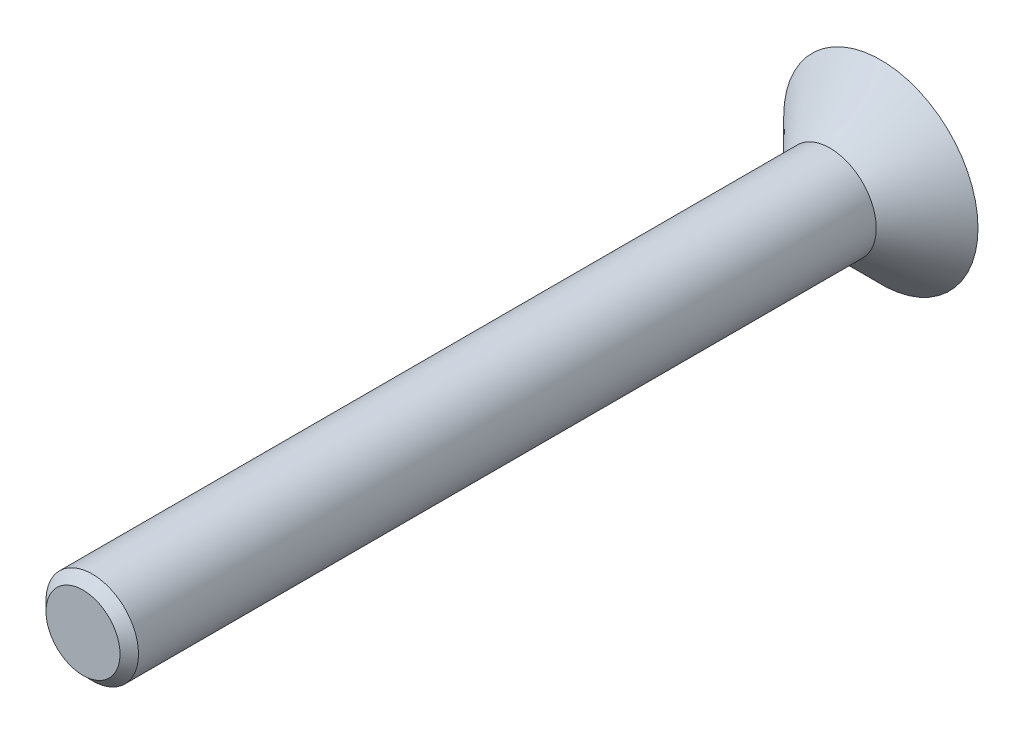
ISO-10303-21;
HEADER;
FILE_DESCRIPTION(('STEP AP214'),'2;1');
FILE_NAME('part.step','',(''),(''),'','','');
FILE_SCHEMA(('AUTOMOTIVE_DESIGN { 1 0 10303 214 1 1 1 1 }'));
ENDSEC;
DATA;
#1=APPLICATION_CONTEXT('core data for automotive mechanical design processes');
#2=APPLICATION_PROTOCOL_DEFINITION('international standard','automotive_design',2000,#1);
#3=PRODUCT_CONTEXT('',#1,'mechanical');
#4=PRODUCT('Part','Part','',(#3));
#5=PRODUCT_RELATED_PRODUCT_CATEGORY('part','',(#4));
#6=PRODUCT_DEFINITION_FORMATION('','',#4);
#7=PRODUCT_DEFINITION_CONTEXT('part definition',#1,'design');
#8=PRODUCT_DEFINITION('design','',#6,#7);
#9=PRODUCT_DEFINITION_SHAPE('','',#8);
#10=(LENGTH_UNIT() NAMED_UNIT(*) SI_UNIT(.MILLI.,.METRE.));
#11=(NAMED_UNIT(*) PLANE_ANGLE_UNIT() SI_UNIT($,.RADIAN.));
#12=(NAMED_UNIT(*) SI_UNIT($,.STERADIAN.) SOLID_ANGLE_UNIT());
#13=UNCERTAINTY_MEASURE_WITH_UNIT(LENGTH_MEASURE(1.E-05),#10,'distance_accuracy_value','');
#14=(GEOMETRIC_REPRESENTATION_CONTEXT(3) GLOBAL_UNCERTAINTY_ASSIGNED_CONTEXT((#13)) GLOBAL_UNIT_ASSIGNED_CONTEXT((#10,
#11,#12)) REPRESENTATION_CONTEXT('',''));
#15=CARTESIAN_POINT('',(0.,0.,0.));
#16=DIRECTION('',(0.,0.,1.));
#17=DIRECTION('',(1.,0.,0.));
#18=AXIS2_PLACEMENT_3D('',#15,#16,#17);
#19=CARTESIAN_POINT('',(0.,0.,-2.19999999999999));
#20=DIRECTION('',(0.,0.,1.));
#21=DIRECTION('',(1.,0.,0.));
#22=AXIS2_PLACEMENT_3D('',#19,#20,#21);
#23=PLANE('',#22);
#24=CARTESIAN_POINT('',(0.,0.,-2.19999999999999));
#25=DIRECTION('',(0.,0.,-1.));
#26=DIRECTION('',(-1.,0.,0.));
#27=AXIS2_PLACEMENT_3D('',#24,#25,#26);
#28=CIRCLE('',#27,4.2);
#29=CARTESIAN_POINT('',(-4.2,0.,-2.19999999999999));
#30=VERTEX_POINT('',#29);
#31=EDGE_CURVE('E141',#30,#30,#28,.T.);
#32=ORIENTED_EDGE('',*,*,#31,.T.);
#33=EDGE_LOOP('',(#32));
#34=FACE_BOUND('',#33,.T.);
#35=DIRECTION('',(-0.86602540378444,0.499999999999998,0.));
#36=VECTOR('',#35,1.);
#37=CARTESIAN_POINT('',(0.,1.44337567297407,-2.19999999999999));
#38=LINE('',#37,#36);
#39=CARTESIAN_POINT('',(1.25,0.721687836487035,-2.19999999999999));
#40=VERTEX_POINT('',#39);
#41=CARTESIAN_POINT('',(0.,1.44337567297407,-2.19999999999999));
#42=VERTEX_POINT('',#41);
#43=EDGE_CURVE('E49',#40,#42,#38,.T.);
#44=ORIENTED_EDGE('',*,*,#43,.T.);
#45=DIRECTION('',(-0.866025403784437,-0.500000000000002,0.));
#46=VECTOR('',#45,1.);
#47=CARTESIAN_POINT('',(-1.25,0.721687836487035,-2.19999999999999));
#48=LINE('',#47,#46);
#49=CARTESIAN_POINT('',(-1.25,0.721687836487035,-2.19999999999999));
#50=VERTEX_POINT('',#49);
#51=EDGE_CURVE('E120',#42,#50,#48,.T.);
#52=ORIENTED_EDGE('',*,*,#51,.T.);
#53=DIRECTION('',(0.,-1.,0.));
#54=VECTOR('',#53,1.);
#55=CARTESIAN_POINT('',(-1.25,-0.721687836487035,-2.19999999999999));
#56=LINE('',#55,#54);
#57=CARTESIAN_POINT('',(-1.25,-0.721687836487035,-2.19999999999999));
#58=VERTEX_POINT('',#57);
#59=EDGE_CURVE('E124',#50,#58,#56,.T.);
#60=ORIENTED_EDGE('',*,*,#59,.T.);
#61=DIRECTION('',(0.866025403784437,-0.500000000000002,0.));
#62=VECTOR('',#61,1.);
#63=CARTESIAN_POINT('',(-1.25,-0.721687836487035,-2.19999999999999));
#64=LINE('',#63,#62);
#65=CARTESIAN_POINT('',(0.,-1.44337567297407,-2.19999999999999));
#66=VERTEX_POINT('',#65);
#67=EDGE_CURVE('E127',#58,#66,#64,.T.);
#68=ORIENTED_EDGE('',*,*,#67,.T.);
#69=DIRECTION('',(0.86602540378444,0.499999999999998,0.));
#70=VECTOR('',#69,1.);
#71=CARTESIAN_POINT('',(0.,-1.44337567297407,-2.19999999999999));
#72=LINE('',#71,#70);
#73=CARTESIAN_POINT('',(1.25,-0.721687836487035,-2.19999999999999));
#74=VERTEX_POINT('',#73);
#75=EDGE_CURVE('E110',#66,#74,#72,.T.);
#76=ORIENTED_EDGE('',*,*,#75,.T.);
#77=DIRECTION('',(0.,1.,0.));
#78=VECTOR('',#77,1.);
#79=CARTESIAN_POINT('',(1.25,-0.721687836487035,-2.19999999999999));
#80=LINE('',#79,#78);
#81=EDGE_CURVE('E130',#74,#40,#80,.T.);
#82=ORIENTED_EDGE('',*,*,#81,.T.);
#83=EDGE_LOOP('',(#44,#52,#60,#68,#76,#82));
#84=FACE_BOUND('',#83,.T.);
#85=ADVANCED_FACE('F34',(#34,#84),#23,.F.);
#86=CARTESIAN_POINT('',(0.,0.,0.));
#87=DIRECTION('',(0.,0.,-1.));
#88=DIRECTION('',(-1.,0.,0.));
#89=AXIS2_PLACEMENT_3D('',#86,#87,#88);
#90=CONICAL_SURFACE('',#89,2.,0.78539816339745);
#91=ORIENTED_EDGE('',*,*,#31,.F.);
#92=EDGE_LOOP('',(#91));
#93=FACE_BOUND('',#92,.T.);
#94=CARTESIAN_POINT('',(0.,0.,0.));
#95=DIRECTION('',(0.,0.,1.));
#96=DIRECTION('',(1.,0.,0.));
#97=AXIS2_PLACEMENT_3D('',#94,#95,#96);
#98=CIRCLE('',#97,2.);
#99=CARTESIAN_POINT('',(2.,0.,0.));
#100=VERTEX_POINT('',#99);
#101=EDGE_CURVE('E121',#100,#100,#98,.T.);
#102=ORIENTED_EDGE('',*,*,#101,.F.);
#103=EDGE_LOOP('',(#102));
#104=FACE_BOUND('',#103,.T.);
#105=ADVANCED_FACE('F158',(#93,#104),#90,.T.);
#106=CARTESIAN_POINT('',(0.,1.44337567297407,-0.199999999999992));
#107=DIRECTION('',(-0.499999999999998,-0.86602540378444,0.));
#108=DIRECTION('',(0.86602540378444,-0.499999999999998,0.));
#109=AXIS2_PLACEMENT_3D('',#106,#107,#108);
#110=PLANE('',#109);
#111=ORIENTED_EDGE('',*,*,#43,.F.);
#112=DIRECTION('',(0.,0.,-1.));
#113=VECTOR('',#112,1.);
#114=CARTESIAN_POINT('',(1.25,0.721687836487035,-0.199999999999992));
#115=LINE('',#114,#113);
#116=CARTESIAN_POINT('',(1.25,0.721687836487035,-0.199999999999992));
#117=VERTEX_POINT('',#116);
#118=EDGE_CURVE('E115',#117,#40,#115,.T.);
#119=ORIENTED_EDGE('',*,*,#118,.F.);
#120=DIRECTION('',(-0.86602540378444,0.499999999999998,0.));
#121=VECTOR('',#120,1.);
#122=CARTESIAN_POINT('',(0.,1.44337567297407,-0.199999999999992));
#123=LINE('',#122,#121);
#124=CARTESIAN_POINT('',(0.,1.44337567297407,-0.199999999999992));
#125=VERTEX_POINT('',#124);
#126=EDGE_CURVE('E133',#117,#125,#123,.T.);
#127=ORIENTED_EDGE('',*,*,#126,.T.);
#128=DIRECTION('',(0.,0.,-1.));
#129=VECTOR('',#128,1.);
#130=CARTESIAN_POINT('',(0.,1.44337567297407,-0.199999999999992));
#131=LINE('',#130,#129);
#132=EDGE_CURVE('E139',#125,#42,#131,.T.);
#133=ORIENTED_EDGE('',*,*,#132,.T.);
#134=EDGE_LOOP('',(#111,#119,#127,#133));
#135=FACE_BOUND('',#134,.T.);
#136=ADVANCED_FACE('F163',(#135),#110,.T.);
#137=CARTESIAN_POINT('',(-1.25,0.721687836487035,-0.199999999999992));
#138=DIRECTION('',(0.500000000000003,-0.866025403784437,0.));
#139=DIRECTION('',(0.866025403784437,0.500000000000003,0.));
#140=AXIS2_PLACEMENT_3D('',#137,#138,#139);
#141=PLANE('',#140);
#142=ORIENTED_EDGE('',*,*,#51,.F.);
#143=ORIENTED_EDGE('',*,*,#132,.F.);
#144=DIRECTION('',(-0.866025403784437,-0.500000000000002,0.));
#145=VECTOR('',#144,1.);
#146=CARTESIAN_POINT('',(-1.25,0.721687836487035,-0.199999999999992));
#147=LINE('',#146,#145);
#148=CARTESIAN_POINT('',(-1.25,0.721687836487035,-0.199999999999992));
#149=VERTEX_POINT('',#148);
#150=EDGE_CURVE('E88',#125,#149,#147,.T.);
#151=ORIENTED_EDGE('',*,*,#150,.T.);
#152=DIRECTION('',(0.,0.,-1.));
#153=VECTOR('',#152,1.);
#154=CARTESIAN_POINT('',(-1.25,0.721687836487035,-0.199999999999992));
#155=LINE('',#154,#153);
#156=EDGE_CURVE('E137',#149,#50,#155,.T.);
#157=ORIENTED_EDGE('',*,*,#156,.T.);
#158=EDGE_LOOP('',(#142,#143,#151,#157));
#159=FACE_BOUND('',#158,.T.);
#160=ADVANCED_FACE('F170',(#159),#141,.T.);
#161=CARTESIAN_POINT('',(-1.25,-0.721687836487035,-0.199999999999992));
#162=DIRECTION('',(1.,0.,0.));
#163=DIRECTION('',(0.,0.,-1.));
#164=AXIS2_PLACEMENT_3D('',#161,#162,#163);
#165=PLANE('',#164);
#166=ORIENTED_EDGE('',*,*,#59,.F.);
#167=ORIENTED_EDGE('',*,*,#156,.F.);
#168=DIRECTION('',(0.,-1.,0.));
#169=VECTOR('',#168,1.);
#170=CARTESIAN_POINT('',(-1.25,-0.721687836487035,-0.199999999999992));
#171=LINE('',#170,#169);
#172=CARTESIAN_POINT('',(-1.25,-0.721687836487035,-0.199999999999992));
#173=VERTEX_POINT('',#172);
#174=EDGE_CURVE('E106',#149,#173,#171,.T.);
#175=ORIENTED_EDGE('',*,*,#174,.T.);
#176=DIRECTION('',(0.,0.,-1.));
#177=VECTOR('',#176,1.);
#178=CARTESIAN_POINT('',(-1.25,-0.721687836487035,-0.199999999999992));
#179=LINE('',#178,#177);
#180=EDGE_CURVE('E103',#173,#58,#179,.T.);
#181=ORIENTED_EDGE('',*,*,#180,.T.);
#182=EDGE_LOOP('',(#166,#167,#175,#181));
#183=FACE_BOUND('',#182,.T.);
#184=ADVANCED_FACE('F173',(#183),#165,.T.);
#185=CARTESIAN_POINT('',(-1.25,-0.721687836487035,-0.199999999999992));
#186=DIRECTION('',(0.500000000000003,0.866025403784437,0.));
#187=DIRECTION('',(-0.866025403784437,0.500000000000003,0.));
#188=AXIS2_PLACEMENT_3D('',#185,#186,#187);
#189=PLANE('',#188);
#190=ORIENTED_EDGE('',*,*,#67,.F.);
#191=ORIENTED_EDGE('',*,*,#180,.F.);
#192=DIRECTION('',(0.866025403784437,-0.500000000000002,0.));
#193=VECTOR('',#192,1.);
#194=CARTESIAN_POINT('',(-1.25,-0.721687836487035,-0.199999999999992));
#195=LINE('',#194,#193);
#196=CARTESIAN_POINT('',(0.,-1.44337567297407,-0.199999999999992));
#197=VERTEX_POINT('',#196);
#198=EDGE_CURVE('E98',#173,#197,#195,.T.);
#199=ORIENTED_EDGE('',*,*,#198,.T.);
#200=DIRECTION('',(0.,0.,-1.));
#201=VECTOR('',#200,1.);
#202=CARTESIAN_POINT('',(0.,-1.44337567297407,-0.199999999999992));
#203=LINE('',#202,#201);
#204=EDGE_CURVE('E102',#197,#66,#203,.T.);
#205=ORIENTED_EDGE('',*,*,#204,.T.);
#206=EDGE_LOOP('',(#190,#191,#199,#205));
#207=FACE_BOUND('',#206,.T.);
#208=ADVANCED_FACE('F101',(#207),#189,.T.);
#209=CARTESIAN_POINT('',(0.,-1.44337567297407,-0.199999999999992));
#210=DIRECTION('',(-0.499999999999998,0.86602540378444,0.));
#211=DIRECTION('',(-0.86602540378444,-0.499999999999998,0.));
#212=AXIS2_PLACEMENT_3D('',#209,#210,#211);
#213=PLANE('',#212);
#214=ORIENTED_EDGE('',*,*,#75,.F.);
#215=ORIENTED_EDGE('',*,*,#204,.F.);
#216=DIRECTION('',(0.86602540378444,0.499999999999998,0.));
#217=VECTOR('',#216,1.);
#218=CARTESIAN_POINT('',(0.,-1.44337567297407,-0.199999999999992));
#219=LINE('',#218,#217);
#220=CARTESIAN_POINT('',(1.25,-0.721687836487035,-0.199999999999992));
#221=VERTEX_POINT('',#220);
#222=EDGE_CURVE('E105',#197,#221,#219,.T.);
#223=ORIENTED_EDGE('',*,*,#222,.T.);
#224=DIRECTION('',(0.,0.,-1.));
#225=VECTOR('',#224,1.);
#226=CARTESIAN_POINT('',(1.25,-0.721687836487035,-0.199999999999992));
#227=LINE('',#226,#225);
#228=EDGE_CURVE('E79',#221,#74,#227,.T.);
#229=ORIENTED_EDGE('',*,*,#228,.T.);
#230=EDGE_LOOP('',(#214,#215,#223,#229));
#231=FACE_BOUND('',#230,.T.);
#232=ADVANCED_FACE('F108',(#231),#213,.T.);
#233=CARTESIAN_POINT('',(1.25,-0.721687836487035,-0.199999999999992));
#234=DIRECTION('',(-1.,0.,0.));
#235=DIRECTION('',(0.,0.,1.));
#236=AXIS2_PLACEMENT_3D('',#233,#234,#235);
#237=PLANE('',#236);
#238=ORIENTED_EDGE('',*,*,#81,.F.);
#239=ORIENTED_EDGE('',*,*,#228,.F.);
#240=DIRECTION('',(0.,1.,0.));
#241=VECTOR('',#240,1.);
#242=CARTESIAN_POINT('',(1.25,-0.721687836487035,-0.199999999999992));
#243=LINE('',#242,#241);
#244=EDGE_CURVE('E57',#221,#117,#243,.T.);
#245=ORIENTED_EDGE('',*,*,#244,.T.);
#246=ORIENTED_EDGE('',*,*,#118,.T.);
#247=EDGE_LOOP('',(#238,#239,#245,#246));
#248=FACE_BOUND('',#247,.T.);
#249=ADVANCED_FACE('F182',(#248),#237,.T.);
#250=CARTESIAN_POINT('',(1.25,0.721687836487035,-0.199999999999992));
#251=DIRECTION('',(0.,0.,1.));
#252=DIRECTION('',(1.,0.,0.));
#253=AXIS2_PLACEMENT_3D('',#250,#251,#252);
#254=PLANE('',#253);
#255=ORIENTED_EDGE('',*,*,#126,.F.);
#256=ORIENTED_EDGE('',*,*,#244,.F.);
#257=ORIENTED_EDGE('',*,*,#222,.F.);
#258=ORIENTED_EDGE('',*,*,#198,.F.);
#259=ORIENTED_EDGE('',*,*,#174,.F.);
#260=ORIENTED_EDGE('',*,*,#150,.F.);
#261=EDGE_LOOP('',(#255,#256,#257,#258,#259,#260));
#262=FACE_BOUND('',#261,.T.);
#263=ADVANCED_FACE('F113',(#262),#254,.F.);
#264=CARTESIAN_POINT('',(0.,0.,32.3));
#265=DIRECTION('',(0.,0.,1.));
#266=DIRECTION('',(1.,0.,0.));
#267=AXIS2_PLACEMENT_3D('',#264,#265,#266);
#268=PLANE('',#267);
#269=CARTESIAN_POINT('',(0.,0.,32.3));
#270=DIRECTION('',(0.,0.,1.));
#271=DIRECTION('',(1.,0.,0.));
#272=AXIS2_PLACEMENT_3D('',#269,#270,#271);
#273=CIRCLE('',#272,1.6);
#274=CARTESIAN_POINT('',(1.60000000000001,0.,32.3));
#275=VERTEX_POINT('',#274);
#276=EDGE_CURVE('E42',#275,#275,#273,.T.);
#277=ORIENTED_EDGE('',*,*,#276,.T.);
#278=EDGE_LOOP('',(#277));
#279=FACE_BOUND('',#278,.T.);
#280=ADVANCED_FACE('F146',(#279),#268,.T.);
#281=CARTESIAN_POINT('',(0.,0.,0.));
#282=DIRECTION('',(0.,0.,1.));
#283=DIRECTION('',(1.,0.,0.));
#284=AXIS2_PLACEMENT_3D('',#281,#282,#283);
#285=CYLINDRICAL_SURFACE('',#284,2.);
#286=CARTESIAN_POINT('',(0.,0.,31.9));
#287=DIRECTION('',(0.,0.,1.));
#288=DIRECTION('',(1.,0.,0.));
#289=AXIS2_PLACEMENT_3D('',#286,#287,#288);
#290=CIRCLE('',#289,2.);
#291=CARTESIAN_POINT('',(2.,0.,31.9));
#292=VERTEX_POINT('',#291);
#293=EDGE_CURVE('E11',#292,#292,#290,.F.);
#294=ORIENTED_EDGE('',*,*,#293,.T.);
#295=EDGE_LOOP('',(#294));
#296=FACE_BOUND('',#295,.T.);
#297=ORIENTED_EDGE('',*,*,#101,.T.);
#298=EDGE_LOOP('',(#297));
#299=FACE_BOUND('',#298,.T.);
#300=ADVANCED_FACE('F149',(#296,#299),#285,.T.);
#301=CARTESIAN_POINT('',(0.,0.,32.3));
#302=DIRECTION('',(0.,0.,-1.));
#303=DIRECTION('',(-1.,0.,0.));
#304=AXIS2_PLACEMENT_3D('',#301,#302,#303);
#305=CONICAL_SURFACE('',#304,1.6,0.785398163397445);
#306=ORIENTED_EDGE('',*,*,#293,.F.);
#307=EDGE_LOOP('',(#306));
#308=FACE_BOUND('',#307,.T.);
#309=ORIENTED_EDGE('',*,*,#276,.F.);
#310=EDGE_LOOP('',(#309));
#311=FACE_BOUND('',#310,.T.);
#312=ADVANCED_FACE('F36',(#308,#311),#305,.T.);
#313=CLOSED_SHELL('',(#85,#105,#136,#160,#184,#208,#232,#249,#263,#280,#300,#312));
#314=MANIFOLD_SOLID_BREP('B2',#313);
#315=ADVANCED_BREP_SHAPE_REPRESENTATION('',(#18,#314),#14);
#316=SHAPE_DEFINITION_REPRESENTATION(#9,#315);
ENDSEC;
END-ISO-10303-21;
